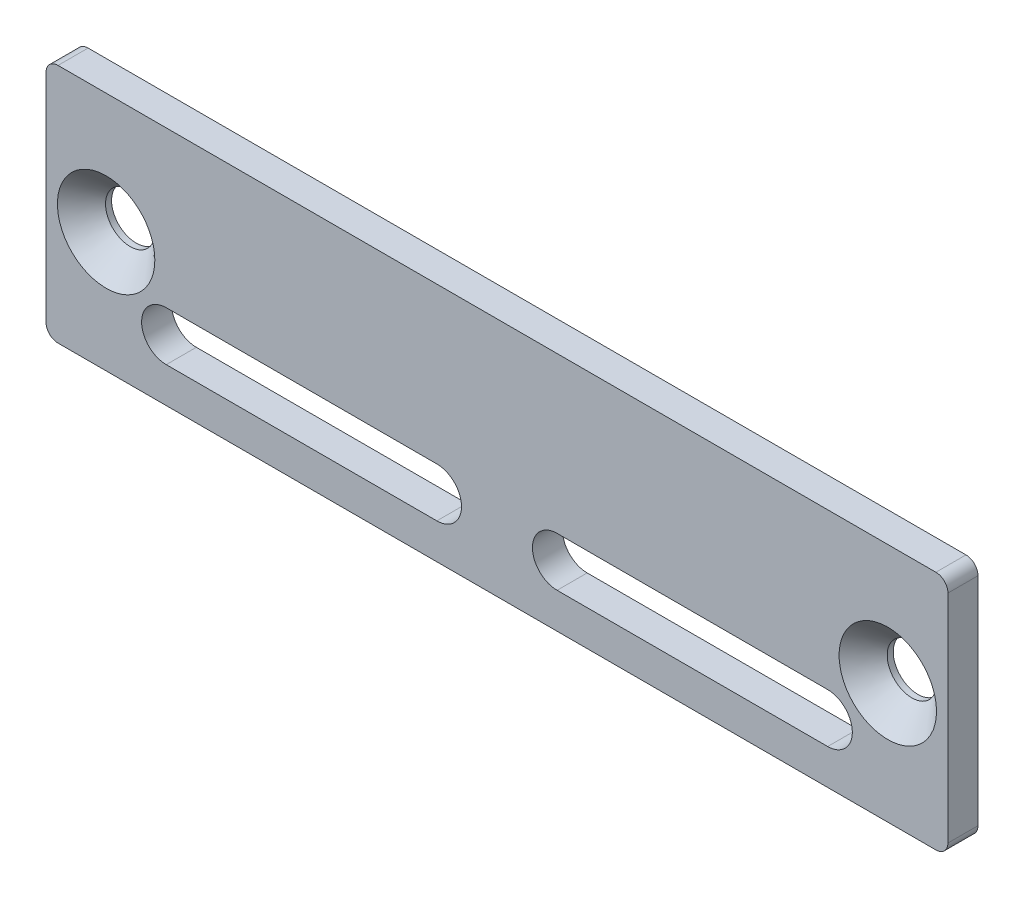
ISO-10303-21;
HEADER;
FILE_DESCRIPTION(('STEP AP214'),'2;1');
FILE_NAME('part.step','',(''),(''),'','','');
FILE_SCHEMA(('AUTOMOTIVE_DESIGN { 1 0 10303 214 1 1 1 1 }'));
ENDSEC;
DATA;
#1=APPLICATION_CONTEXT('core data for automotive mechanical design processes');
#2=APPLICATION_PROTOCOL_DEFINITION('international standard','automotive_design',2000,#1);
#3=PRODUCT_CONTEXT('',#1,'mechanical');
#4=PRODUCT('Part','Part','',(#3));
#5=PRODUCT_RELATED_PRODUCT_CATEGORY('part','',(#4));
#6=PRODUCT_DEFINITION_FORMATION('','',#4);
#7=PRODUCT_DEFINITION_CONTEXT('part definition',#1,'design');
#8=PRODUCT_DEFINITION('design','',#6,#7);
#9=PRODUCT_DEFINITION_SHAPE('','',#8);
#10=(LENGTH_UNIT() NAMED_UNIT(*) SI_UNIT(.MILLI.,.METRE.));
#11=(NAMED_UNIT(*) PLANE_ANGLE_UNIT() SI_UNIT($,.RADIAN.));
#12=(NAMED_UNIT(*) SI_UNIT($,.STERADIAN.) SOLID_ANGLE_UNIT());
#13=UNCERTAINTY_MEASURE_WITH_UNIT(LENGTH_MEASURE(1.E-05),#10,'distance_accuracy_value','');
#14=(GEOMETRIC_REPRESENTATION_CONTEXT(3) GLOBAL_UNCERTAINTY_ASSIGNED_CONTEXT((#13)) GLOBAL_UNIT_ASSIGNED_CONTEXT((#10,
#11,#12)) REPRESENTATION_CONTEXT('',''));
#15=CARTESIAN_POINT('',(0.,0.,0.));
#16=DIRECTION('',(0.,0.,1.));
#17=DIRECTION('',(1.,0.,0.));
#18=AXIS2_PLACEMENT_3D('',#15,#16,#17);
#19=CARTESIAN_POINT('',(-73.,-18.,5.));
#20=DIRECTION('',(0.,0.,-1.));
#21=DIRECTION('',(-1.,0.,0.));
#22=AXIS2_PLACEMENT_3D('',#19,#20,#21);
#23=CYLINDRICAL_SURFACE('',#22,2.);
#24=CARTESIAN_POINT('',(-73.,-18.,0.));
#25=DIRECTION('',(0.,0.,1.));
#26=DIRECTION('',(1.,0.,0.));
#27=AXIS2_PLACEMENT_3D('',#24,#25,#26);
#28=CIRCLE('',#27,2.);
#29=CARTESIAN_POINT('',(-75.,-18.,0.));
#30=VERTEX_POINT('',#29);
#31=CARTESIAN_POINT('',(-73.,-20.,0.));
#32=VERTEX_POINT('',#31);
#33=EDGE_CURVE('E203',#30,#32,#28,.T.);
#34=ORIENTED_EDGE('',*,*,#33,.T.);
#35=DIRECTION('',(0.,0.,-1.));
#36=VECTOR('',#35,1.);
#37=CARTESIAN_POINT('',(-73.,-20.,5.));
#38=LINE('',#37,#36);
#39=CARTESIAN_POINT('',(-73.,-20.,5.));
#40=VERTEX_POINT('',#39);
#41=EDGE_CURVE('E11',#40,#32,#38,.T.);
#42=ORIENTED_EDGE('',*,*,#41,.F.);
#43=CARTESIAN_POINT('',(-73.,-18.,5.));
#44=DIRECTION('',(0.,0.,1.));
#45=DIRECTION('',(1.,0.,0.));
#46=AXIS2_PLACEMENT_3D('',#43,#44,#45);
#47=CIRCLE('',#46,2.);
#48=CARTESIAN_POINT('',(-75.,-18.,5.));
#49=VERTEX_POINT('',#48);
#50=EDGE_CURVE('E250',#49,#40,#47,.T.);
#51=ORIENTED_EDGE('',*,*,#50,.F.);
#52=DIRECTION('',(0.,0.,-1.));
#53=VECTOR('',#52,1.);
#54=CARTESIAN_POINT('',(-75.,-18.,5.));
#55=LINE('',#54,#53);
#56=EDGE_CURVE('E276',#49,#30,#55,.T.);
#57=ORIENTED_EDGE('',*,*,#56,.T.);
#58=EDGE_LOOP('',(#34,#42,#51,#57));
#59=FACE_BOUND('',#58,.T.);
#60=ADVANCED_FACE('F40',(#59),#23,.T.);
#61=CARTESIAN_POINT('',(-73.,-20.,5.));
#62=DIRECTION('',(0.,1.,0.));
#63=DIRECTION('',(0.,0.,1.));
#64=AXIS2_PLACEMENT_3D('',#61,#62,#63);
#65=PLANE('',#64);
#66=DIRECTION('',(1.,0.,0.));
#67=VECTOR('',#66,1.);
#68=CARTESIAN_POINT('',(-73.,-20.,0.));
#69=LINE('',#68,#67);
#70=CARTESIAN_POINT('',(73.,-20.,0.));
#71=VERTEX_POINT('',#70);
#72=EDGE_CURVE('E280',#32,#71,#69,.T.);
#73=ORIENTED_EDGE('',*,*,#72,.T.);
#74=DIRECTION('',(0.,0.,-1.));
#75=VECTOR('',#74,1.);
#76=CARTESIAN_POINT('',(73.,-20.,5.));
#77=LINE('',#76,#75);
#78=CARTESIAN_POINT('',(73.,-20.,5.));
#79=VERTEX_POINT('',#78);
#80=EDGE_CURVE('E48',#79,#71,#77,.T.);
#81=ORIENTED_EDGE('',*,*,#80,.F.);
#82=DIRECTION('',(1.,0.,0.));
#83=VECTOR('',#82,1.);
#84=CARTESIAN_POINT('',(-73.,-20.,5.));
#85=LINE('',#84,#83);
#86=EDGE_CURVE('E254',#40,#79,#85,.T.);
#87=ORIENTED_EDGE('',*,*,#86,.F.);
#88=ORIENTED_EDGE('',*,*,#41,.T.);
#89=EDGE_LOOP('',(#73,#81,#87,#88));
#90=FACE_BOUND('',#89,.T.);
#91=ADVANCED_FACE('F350',(#90),#65,.F.);
#92=CARTESIAN_POINT('',(73.,-18.,5.));
#93=DIRECTION('',(0.,0.,-1.));
#94=DIRECTION('',(-1.,0.,0.));
#95=AXIS2_PLACEMENT_3D('',#92,#93,#94);
#96=CYLINDRICAL_SURFACE('',#95,2.);
#97=CARTESIAN_POINT('',(73.,-18.,0.));
#98=DIRECTION('',(0.,0.,1.));
#99=DIRECTION('',(1.,0.,0.));
#100=AXIS2_PLACEMENT_3D('',#97,#98,#99);
#101=CIRCLE('',#100,2.);
#102=CARTESIAN_POINT('',(75.,-18.,0.));
#103=VERTEX_POINT('',#102);
#104=EDGE_CURVE('E283',#71,#103,#101,.T.);
#105=ORIENTED_EDGE('',*,*,#104,.T.);
#106=DIRECTION('',(0.,0.,-1.));
#107=VECTOR('',#106,1.);
#108=CARTESIAN_POINT('',(75.,-18.,5.));
#109=LINE('',#108,#107);
#110=CARTESIAN_POINT('',(75.,-18.,5.));
#111=VERTEX_POINT('',#110);
#112=EDGE_CURVE('E319',#111,#103,#109,.T.);
#113=ORIENTED_EDGE('',*,*,#112,.F.);
#114=CARTESIAN_POINT('',(73.,-18.,5.));
#115=DIRECTION('',(0.,0.,1.));
#116=DIRECTION('',(1.,0.,0.));
#117=AXIS2_PLACEMENT_3D('',#114,#115,#116);
#118=CIRCLE('',#117,2.);
#119=EDGE_CURVE('E258',#79,#111,#118,.T.);
#120=ORIENTED_EDGE('',*,*,#119,.F.);
#121=ORIENTED_EDGE('',*,*,#80,.T.);
#122=EDGE_LOOP('',(#105,#113,#120,#121));
#123=FACE_BOUND('',#122,.T.);
#124=ADVANCED_FACE('F328',(#123),#96,.T.);
#125=CARTESIAN_POINT('',(75.,18.,5.));
#126=DIRECTION('',(-1.,0.,0.));
#127=DIRECTION('',(0.,0.,1.));
#128=AXIS2_PLACEMENT_3D('',#125,#126,#127);
#129=PLANE('',#128);
#130=DIRECTION('',(0.,1.,0.));
#131=VECTOR('',#130,1.);
#132=CARTESIAN_POINT('',(75.,18.,0.));
#133=LINE('',#132,#131);
#134=CARTESIAN_POINT('',(75.,18.,0.));
#135=VERTEX_POINT('',#134);
#136=EDGE_CURVE('E286',#103,#135,#133,.T.);
#137=ORIENTED_EDGE('',*,*,#136,.T.);
#138=DIRECTION('',(0.,0.,-1.));
#139=VECTOR('',#138,1.);
#140=CARTESIAN_POINT('',(75.,18.,5.));
#141=LINE('',#140,#139);
#142=CARTESIAN_POINT('',(75.,18.,5.));
#143=VERTEX_POINT('',#142);
#144=EDGE_CURVE('E315',#143,#135,#141,.T.);
#145=ORIENTED_EDGE('',*,*,#144,.F.);
#146=DIRECTION('',(0.,1.,0.));
#147=VECTOR('',#146,1.);
#148=CARTESIAN_POINT('',(75.,18.,5.));
#149=LINE('',#148,#147);
#150=EDGE_CURVE('E261',#111,#143,#149,.T.);
#151=ORIENTED_EDGE('',*,*,#150,.F.);
#152=ORIENTED_EDGE('',*,*,#112,.T.);
#153=EDGE_LOOP('',(#137,#145,#151,#152));
#154=FACE_BOUND('',#153,.T.);
#155=ADVANCED_FACE('F338',(#154),#129,.F.);
#156=CARTESIAN_POINT('',(73.,18.,5.));
#157=DIRECTION('',(0.,0.,-1.));
#158=DIRECTION('',(-1.,0.,0.));
#159=AXIS2_PLACEMENT_3D('',#156,#157,#158);
#160=CYLINDRICAL_SURFACE('',#159,2.);
#161=CARTESIAN_POINT('',(73.,18.,0.));
#162=DIRECTION('',(0.,0.,1.));
#163=DIRECTION('',(-1.,0.,0.));
#164=AXIS2_PLACEMENT_3D('',#161,#162,#163);
#165=CIRCLE('',#164,2.);
#166=CARTESIAN_POINT('',(73.,20.,0.));
#167=VERTEX_POINT('',#166);
#168=EDGE_CURVE('E289',#135,#167,#165,.T.);
#169=ORIENTED_EDGE('',*,*,#168,.T.);
#170=DIRECTION('',(0.,0.,-1.));
#171=VECTOR('',#170,1.);
#172=CARTESIAN_POINT('',(73.,20.,5.));
#173=LINE('',#172,#171);
#174=CARTESIAN_POINT('',(73.,20.,5.));
#175=VERTEX_POINT('',#174);
#176=EDGE_CURVE('E311',#175,#167,#173,.T.);
#177=ORIENTED_EDGE('',*,*,#176,.F.);
#178=CARTESIAN_POINT('',(73.,18.,5.));
#179=DIRECTION('',(0.,0.,1.));
#180=DIRECTION('',(-1.,0.,0.));
#181=AXIS2_PLACEMENT_3D('',#178,#179,#180);
#182=CIRCLE('',#181,2.);
#183=EDGE_CURVE('E264',#143,#175,#182,.T.);
#184=ORIENTED_EDGE('',*,*,#183,.F.);
#185=ORIENTED_EDGE('',*,*,#144,.T.);
#186=EDGE_LOOP('',(#169,#177,#184,#185));
#187=FACE_BOUND('',#186,.T.);
#188=ADVANCED_FACE('F342',(#187),#160,.T.);
#189=CARTESIAN_POINT('',(-73.,20.,5.));
#190=DIRECTION('',(0.,-1.,0.));
#191=DIRECTION('',(0.,0.,-1.));
#192=AXIS2_PLACEMENT_3D('',#189,#190,#191);
#193=PLANE('',#192);
#194=DIRECTION('',(-1.,0.,0.));
#195=VECTOR('',#194,1.);
#196=CARTESIAN_POINT('',(-73.,20.,0.));
#197=LINE('',#196,#195);
#198=CARTESIAN_POINT('',(-73.,20.,0.));
#199=VERTEX_POINT('',#198);
#200=EDGE_CURVE('E292',#167,#199,#197,.T.);
#201=ORIENTED_EDGE('',*,*,#200,.T.);
#202=DIRECTION('',(0.,0.,-1.));
#203=VECTOR('',#202,1.);
#204=CARTESIAN_POINT('',(-73.,20.,5.));
#205=LINE('',#204,#203);
#206=CARTESIAN_POINT('',(-73.,20.,5.));
#207=VERTEX_POINT('',#206);
#208=EDGE_CURVE('E307',#207,#199,#205,.T.);
#209=ORIENTED_EDGE('',*,*,#208,.F.);
#210=DIRECTION('',(-1.,0.,0.));
#211=VECTOR('',#210,1.);
#212=CARTESIAN_POINT('',(-73.,20.,5.));
#213=LINE('',#212,#211);
#214=EDGE_CURVE('E267',#175,#207,#213,.T.);
#215=ORIENTED_EDGE('',*,*,#214,.F.);
#216=ORIENTED_EDGE('',*,*,#176,.T.);
#217=EDGE_LOOP('',(#201,#209,#215,#216));
#218=FACE_BOUND('',#217,.T.);
#219=ADVANCED_FACE('F363',(#218),#193,.F.);
#220=CARTESIAN_POINT('',(-73.,18.,5.));
#221=DIRECTION('',(0.,0.,-1.));
#222=DIRECTION('',(-1.,0.,0.));
#223=AXIS2_PLACEMENT_3D('',#220,#221,#222);
#224=CYLINDRICAL_SURFACE('',#223,2.);
#225=CARTESIAN_POINT('',(-73.,18.,0.));
#226=DIRECTION('',(0.,0.,1.));
#227=DIRECTION('',(1.,0.,0.));
#228=AXIS2_PLACEMENT_3D('',#225,#226,#227);
#229=CIRCLE('',#228,2.);
#230=CARTESIAN_POINT('',(-75.,18.,0.));
#231=VERTEX_POINT('',#230);
#232=EDGE_CURVE('E295',#199,#231,#229,.T.);
#233=ORIENTED_EDGE('',*,*,#232,.T.);
#234=DIRECTION('',(0.,0.,-1.));
#235=VECTOR('',#234,1.);
#236=CARTESIAN_POINT('',(-75.,18.,5.));
#237=LINE('',#236,#235);
#238=CARTESIAN_POINT('',(-75.,18.,5.));
#239=VERTEX_POINT('',#238);
#240=EDGE_CURVE('E303',#239,#231,#237,.T.);
#241=ORIENTED_EDGE('',*,*,#240,.F.);
#242=CARTESIAN_POINT('',(-73.,18.,5.));
#243=DIRECTION('',(0.,0.,1.));
#244=DIRECTION('',(1.,0.,0.));
#245=AXIS2_PLACEMENT_3D('',#242,#243,#244);
#246=CIRCLE('',#245,2.);
#247=EDGE_CURVE('E270',#207,#239,#246,.T.);
#248=ORIENTED_EDGE('',*,*,#247,.F.);
#249=ORIENTED_EDGE('',*,*,#208,.T.);
#250=EDGE_LOOP('',(#233,#241,#248,#249));
#251=FACE_BOUND('',#250,.T.);
#252=ADVANCED_FACE('F361',(#251),#224,.T.);
#253=CARTESIAN_POINT('',(-75.,18.,5.));
#254=DIRECTION('',(1.,0.,0.));
#255=DIRECTION('',(0.,0.,-1.));
#256=AXIS2_PLACEMENT_3D('',#253,#254,#255);
#257=PLANE('',#256);
#258=DIRECTION('',(0.,-1.,0.));
#259=VECTOR('',#258,1.);
#260=CARTESIAN_POINT('',(-75.,18.,0.));
#261=LINE('',#260,#259);
#262=EDGE_CURVE('E255',#231,#30,#261,.T.);
#263=ORIENTED_EDGE('',*,*,#262,.T.);
#264=ORIENTED_EDGE('',*,*,#56,.F.);
#265=DIRECTION('',(0.,-1.,0.));
#266=VECTOR('',#265,1.);
#267=CARTESIAN_POINT('',(-75.,18.,5.));
#268=LINE('',#267,#266);
#269=EDGE_CURVE('E273',#239,#49,#268,.T.);
#270=ORIENTED_EDGE('',*,*,#269,.F.);
#271=ORIENTED_EDGE('',*,*,#240,.T.);
#272=EDGE_LOOP('',(#263,#264,#270,#271));
#273=FACE_BOUND('',#272,.T.);
#274=ADVANCED_FACE('F356',(#273),#257,.F.);
#275=CARTESIAN_POINT('',(-73.,-18.,5.));
#276=DIRECTION('',(0.,0.,1.));
#277=DIRECTION('',(1.,0.,0.));
#278=AXIS2_PLACEMENT_3D('',#275,#276,#277);
#279=PLANE('',#278);
#280=CARTESIAN_POINT('',(-65.,0.,5.));
#281=DIRECTION('',(0.,0.,1.));
#282=DIRECTION('',(1.,0.,0.));
#283=AXIS2_PLACEMENT_3D('',#280,#281,#282);
#284=CIRCLE('',#283,8.1);
#285=CARTESIAN_POINT('',(-56.9,0.,5.));
#286=VERTEX_POINT('',#285);
#287=EDGE_CURVE('E551',#286,#286,#284,.T.);
#288=ORIENTED_EDGE('',*,*,#287,.F.);
#289=EDGE_LOOP('',(#288));
#290=FACE_BOUND('',#289,.T.);
#291=CARTESIAN_POINT('',(65.,0.,5.));
#292=DIRECTION('',(0.,0.,1.));
#293=DIRECTION('',(1.,0.,0.));
#294=AXIS2_PLACEMENT_3D('',#291,#292,#293);
#295=CIRCLE('',#294,8.1);
#296=CARTESIAN_POINT('',(73.1,0.,5.));
#297=VERTEX_POINT('',#296);
#298=EDGE_CURVE('E561',#297,#297,#295,.T.);
#299=ORIENTED_EDGE('',*,*,#298,.F.);
#300=EDGE_LOOP('',(#299));
#301=FACE_BOUND('',#300,.T.);
#302=CARTESIAN_POINT('',(-55.,-9.99999999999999,5.));
#303=DIRECTION('',(0.,0.,1.));
#304=DIRECTION('',(1.,0.,0.));
#305=AXIS2_PLACEMENT_3D('',#302,#303,#304);
#306=CIRCLE('',#305,4.09999999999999);
#307=CARTESIAN_POINT('',(-55.,-5.90000000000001,5.));
#308=VERTEX_POINT('',#307);
#309=CARTESIAN_POINT('',(-55.,-14.1,5.));
#310=VERTEX_POINT('',#309);
#311=EDGE_CURVE('E55',#308,#310,#306,.T.);
#312=ORIENTED_EDGE('',*,*,#311,.F.);
#313=DIRECTION('',(-1.,0.,0.));
#314=VECTOR('',#313,1.);
#315=CARTESIAN_POINT('',(-55.,-5.90000000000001,5.));
#316=LINE('',#315,#314);
#317=CARTESIAN_POINT('',(-10.,-5.90000000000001,5.));
#318=VERTEX_POINT('',#317);
#319=EDGE_CURVE('E177',#318,#308,#316,.T.);
#320=ORIENTED_EDGE('',*,*,#319,.F.);
#321=CARTESIAN_POINT('',(-10.,-9.99999999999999,5.));
#322=DIRECTION('',(0.,0.,1.));
#323=DIRECTION('',(1.,0.,0.));
#324=AXIS2_PLACEMENT_3D('',#321,#322,#323);
#325=CIRCLE('',#324,4.09999999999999);
#326=CARTESIAN_POINT('',(-10.,-14.1,5.));
#327=VERTEX_POINT('',#326);
#328=EDGE_CURVE('E181',#327,#318,#325,.T.);
#329=ORIENTED_EDGE('',*,*,#328,.F.);
#330=DIRECTION('',(1.,0.,0.));
#331=VECTOR('',#330,1.);
#332=CARTESIAN_POINT('',(-55.,-14.1,5.));
#333=LINE('',#332,#331);
#334=EDGE_CURVE('E193',#310,#327,#333,.T.);
#335=ORIENTED_EDGE('',*,*,#334,.F.);
#336=EDGE_LOOP('',(#312,#320,#329,#335));
#337=FACE_BOUND('',#336,.T.);
#338=CARTESIAN_POINT('',(55.,-9.99999999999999,5.));
#339=DIRECTION('',(0.,0.,1.));
#340=DIRECTION('',(-1.,0.,0.));
#341=AXIS2_PLACEMENT_3D('',#338,#339,#340);
#342=CIRCLE('',#341,4.09999999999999);
#343=CARTESIAN_POINT('',(55.,-14.1,5.));
#344=VERTEX_POINT('',#343);
#345=CARTESIAN_POINT('',(55.,-5.90000000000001,5.));
#346=VERTEX_POINT('',#345);
#347=EDGE_CURVE('E63',#344,#346,#342,.T.);
#348=ORIENTED_EDGE('',*,*,#347,.F.);
#349=DIRECTION('',(1.,0.,0.));
#350=VECTOR('',#349,1.);
#351=CARTESIAN_POINT('',(55.,-14.1,5.));
#352=LINE('',#351,#350);
#353=CARTESIAN_POINT('',(10.,-14.1,5.));
#354=VERTEX_POINT('',#353);
#355=EDGE_CURVE('E214',#354,#344,#352,.T.);
#356=ORIENTED_EDGE('',*,*,#355,.F.);
#357=CARTESIAN_POINT('',(10.,-9.99999999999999,5.));
#358=DIRECTION('',(0.,0.,1.));
#359=DIRECTION('',(-1.,0.,0.));
#360=AXIS2_PLACEMENT_3D('',#357,#358,#359);
#361=CIRCLE('',#360,4.09999999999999);
#362=CARTESIAN_POINT('',(10.,-5.90000000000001,5.));
#363=VERTEX_POINT('',#362);
#364=EDGE_CURVE('E233',#363,#354,#361,.T.);
#365=ORIENTED_EDGE('',*,*,#364,.F.);
#366=DIRECTION('',(-1.,0.,0.));
#367=VECTOR('',#366,1.);
#368=CARTESIAN_POINT('',(55.,-5.90000000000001,5.));
#369=LINE('',#368,#367);
#370=EDGE_CURVE('E229',#346,#363,#369,.T.);
#371=ORIENTED_EDGE('',*,*,#370,.F.);
#372=EDGE_LOOP('',(#348,#356,#365,#371));
#373=FACE_BOUND('',#372,.T.);
#374=ORIENTED_EDGE('',*,*,#50,.T.);
#375=ORIENTED_EDGE('',*,*,#86,.T.);
#376=ORIENTED_EDGE('',*,*,#119,.T.);
#377=ORIENTED_EDGE('',*,*,#150,.T.);
#378=ORIENTED_EDGE('',*,*,#183,.T.);
#379=ORIENTED_EDGE('',*,*,#214,.T.);
#380=ORIENTED_EDGE('',*,*,#247,.T.);
#381=ORIENTED_EDGE('',*,*,#269,.T.);
#382=EDGE_LOOP('',(#374,#375,#376,#377,#378,#379,#380,#381));
#383=FACE_BOUND('',#382,.T.);
#384=ADVANCED_FACE('F346',(#290,#301,#337,#373,#383),#279,.T.);
#385=CARTESIAN_POINT('',(-73.,-18.,0.));
#386=DIRECTION('',(0.,0.,1.));
#387=DIRECTION('',(1.,0.,0.));
#388=AXIS2_PLACEMENT_3D('',#385,#386,#387);
#389=PLANE('',#388);
#390=CARTESIAN_POINT('',(-65.,0.,0.));
#391=DIRECTION('',(0.,0.,1.));
#392=DIRECTION('',(1.,0.,0.));
#393=AXIS2_PLACEMENT_3D('',#390,#391,#392);
#394=CIRCLE('',#393,4.09999999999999);
#395=CARTESIAN_POINT('',(-60.9,0.,0.));
#396=VERTEX_POINT('',#395);
#397=EDGE_CURVE('E555',#396,#396,#394,.T.);
#398=ORIENTED_EDGE('',*,*,#397,.T.);
#399=EDGE_LOOP('',(#398));
#400=FACE_BOUND('',#399,.T.);
#401=CARTESIAN_POINT('',(65.,0.,0.));
#402=DIRECTION('',(0.,0.,1.));
#403=DIRECTION('',(1.,0.,0.));
#404=AXIS2_PLACEMENT_3D('',#401,#402,#403);
#405=CIRCLE('',#404,4.09999999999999);
#406=CARTESIAN_POINT('',(69.1,0.,0.));
#407=VERTEX_POINT('',#406);
#408=EDGE_CURVE('E184',#407,#407,#405,.T.);
#409=ORIENTED_EDGE('',*,*,#408,.T.);
#410=EDGE_LOOP('',(#409));
#411=FACE_BOUND('',#410,.T.);
#412=DIRECTION('',(-1.,0.,0.));
#413=VECTOR('',#412,1.);
#414=CARTESIAN_POINT('',(-55.,-5.90000000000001,0.));
#415=LINE('',#414,#413);
#416=CARTESIAN_POINT('',(-10.,-5.90000000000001,0.));
#417=VERTEX_POINT('',#416);
#418=CARTESIAN_POINT('',(-55.,-5.90000000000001,0.));
#419=VERTEX_POINT('',#418);
#420=EDGE_CURVE('E162',#417,#419,#415,.T.);
#421=ORIENTED_EDGE('',*,*,#420,.T.);
#422=CARTESIAN_POINT('',(-55.,-9.99999999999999,0.));
#423=DIRECTION('',(0.,0.,1.));
#424=DIRECTION('',(1.,0.,0.));
#425=AXIS2_PLACEMENT_3D('',#422,#423,#424);
#426=CIRCLE('',#425,4.09999999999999);
#427=CARTESIAN_POINT('',(-55.,-14.1,0.));
#428=VERTEX_POINT('',#427);
#429=EDGE_CURVE('E155',#419,#428,#426,.T.);
#430=ORIENTED_EDGE('',*,*,#429,.T.);
#431=DIRECTION('',(1.,0.,0.));
#432=VECTOR('',#431,1.);
#433=CARTESIAN_POINT('',(-55.,-14.1,0.));
#434=LINE('',#433,#432);
#435=CARTESIAN_POINT('',(-10.,-14.1,0.));
#436=VERTEX_POINT('',#435);
#437=EDGE_CURVE('E166',#428,#436,#434,.T.);
#438=ORIENTED_EDGE('',*,*,#437,.T.);
#439=CARTESIAN_POINT('',(-10.,-9.99999999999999,0.));
#440=DIRECTION('',(0.,0.,1.));
#441=DIRECTION('',(1.,0.,0.));
#442=AXIS2_PLACEMENT_3D('',#439,#440,#441);
#443=CIRCLE('',#442,4.09999999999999);
#444=EDGE_CURVE('E171',#436,#417,#443,.T.);
#445=ORIENTED_EDGE('',*,*,#444,.T.);
#446=EDGE_LOOP('',(#421,#430,#438,#445));
#447=FACE_BOUND('',#446,.T.);
#448=DIRECTION('',(1.,0.,0.));
#449=VECTOR('',#448,1.);
#450=CARTESIAN_POINT('',(55.,-14.1,0.));
#451=LINE('',#450,#449);
#452=CARTESIAN_POINT('',(10.,-14.1,0.));
#453=VERTEX_POINT('',#452);
#454=CARTESIAN_POINT('',(55.,-14.1,0.));
#455=VERTEX_POINT('',#454);
#456=EDGE_CURVE('E222',#453,#455,#451,.T.);
#457=ORIENTED_EDGE('',*,*,#456,.T.);
#458=CARTESIAN_POINT('',(55.,-9.99999999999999,0.));
#459=DIRECTION('',(0.,0.,1.));
#460=DIRECTION('',(-1.,0.,0.));
#461=AXIS2_PLACEMENT_3D('',#458,#459,#460);
#462=CIRCLE('',#461,4.09999999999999);
#463=CARTESIAN_POINT('',(55.,-5.90000000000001,0.));
#464=VERTEX_POINT('',#463);
#465=EDGE_CURVE('E209',#455,#464,#462,.T.);
#466=ORIENTED_EDGE('',*,*,#465,.T.);
#467=DIRECTION('',(-1.,0.,0.));
#468=VECTOR('',#467,1.);
#469=CARTESIAN_POINT('',(55.,-5.90000000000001,0.));
#470=LINE('',#469,#468);
#471=CARTESIAN_POINT('',(9.99999999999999,-5.90000000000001,0.));
#472=VERTEX_POINT('',#471);
#473=EDGE_CURVE('E213',#464,#472,#470,.T.);
#474=ORIENTED_EDGE('',*,*,#473,.T.);
#475=CARTESIAN_POINT('',(10.,-9.99999999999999,0.));
#476=DIRECTION('',(0.,0.,1.));
#477=DIRECTION('',(-1.,0.,0.));
#478=AXIS2_PLACEMENT_3D('',#475,#476,#477);
#479=CIRCLE('',#478,4.09999999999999);
#480=EDGE_CURVE('E218',#472,#453,#479,.T.);
#481=ORIENTED_EDGE('',*,*,#480,.T.);
#482=EDGE_LOOP('',(#457,#466,#474,#481));
#483=FACE_BOUND('',#482,.T.);
#484=ORIENTED_EDGE('',*,*,#33,.F.);
#485=ORIENTED_EDGE('',*,*,#262,.F.);
#486=ORIENTED_EDGE('',*,*,#232,.F.);
#487=ORIENTED_EDGE('',*,*,#200,.F.);
#488=ORIENTED_EDGE('',*,*,#168,.F.);
#489=ORIENTED_EDGE('',*,*,#136,.F.);
#490=ORIENTED_EDGE('',*,*,#104,.F.);
#491=ORIENTED_EDGE('',*,*,#72,.F.);
#492=EDGE_LOOP('',(#484,#485,#486,#487,#488,#489,#490,#491));
#493=FACE_BOUND('',#492,.T.);
#494=ADVANCED_FACE('F173',(#400,#411,#447,#483,#493),#389,.F.);
#495=CARTESIAN_POINT('',(55.,-9.99999999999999,0.));
#496=DIRECTION('',(0.,0.,1.));
#497=DIRECTION('',(1.,0.,0.));
#498=AXIS2_PLACEMENT_3D('',#495,#496,#497);
#499=CYLINDRICAL_SURFACE('',#498,4.09999999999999);
#500=ORIENTED_EDGE('',*,*,#347,.T.);
#501=DIRECTION('',(0.,0.,1.));
#502=VECTOR('',#501,1.);
#503=CARTESIAN_POINT('',(55.,-5.90000000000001,0.));
#504=LINE('',#503,#502);
#505=EDGE_CURVE('E226',#464,#346,#504,.T.);
#506=ORIENTED_EDGE('',*,*,#505,.F.);
#507=ORIENTED_EDGE('',*,*,#465,.F.);
#508=DIRECTION('',(0.,0.,1.));
#509=VECTOR('',#508,1.);
#510=CARTESIAN_POINT('',(55.,-14.1,0.));
#511=LINE('',#510,#509);
#512=EDGE_CURVE('E194',#455,#344,#511,.T.);
#513=ORIENTED_EDGE('',*,*,#512,.T.);
#514=EDGE_LOOP('',(#500,#506,#507,#513));
#515=FACE_BOUND('',#514,.T.);
#516=ADVANCED_FACE('F415',(#515),#499,.F.);
#517=CARTESIAN_POINT('',(55.,-14.1,0.));
#518=DIRECTION('',(0.,-1.,0.));
#519=DIRECTION('',(1.,0.,0.));
#520=AXIS2_PLACEMENT_3D('',#517,#518,#519);
#521=PLANE('',#520);
#522=ORIENTED_EDGE('',*,*,#355,.T.);
#523=ORIENTED_EDGE('',*,*,#512,.F.);
#524=ORIENTED_EDGE('',*,*,#456,.F.);
#525=DIRECTION('',(0.,0.,1.));
#526=VECTOR('',#525,1.);
#527=CARTESIAN_POINT('',(10.,-14.1,0.));
#528=LINE('',#527,#526);
#529=EDGE_CURVE('E242',#453,#354,#528,.T.);
#530=ORIENTED_EDGE('',*,*,#529,.T.);
#531=EDGE_LOOP('',(#522,#523,#524,#530));
#532=FACE_BOUND('',#531,.T.);
#533=ADVANCED_FACE('F420',(#532),#521,.F.);
#534=CARTESIAN_POINT('',(10.,-9.99999999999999,0.));
#535=DIRECTION('',(0.,0.,1.));
#536=DIRECTION('',(1.,0.,0.));
#537=AXIS2_PLACEMENT_3D('',#534,#535,#536);
#538=CYLINDRICAL_SURFACE('',#537,4.09999999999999);
#539=ORIENTED_EDGE('',*,*,#364,.T.);
#540=ORIENTED_EDGE('',*,*,#529,.F.);
#541=ORIENTED_EDGE('',*,*,#480,.F.);
#542=DIRECTION('',(0.,0.,1.));
#543=VECTOR('',#542,1.);
#544=CARTESIAN_POINT('',(10.,-5.90000000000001,0.));
#545=LINE('',#544,#543);
#546=EDGE_CURVE('E245',#472,#363,#545,.T.);
#547=ORIENTED_EDGE('',*,*,#546,.T.);
#548=EDGE_LOOP('',(#539,#540,#541,#547));
#549=FACE_BOUND('',#548,.T.);
#550=ADVANCED_FACE('F431',(#549),#538,.F.);
#551=CARTESIAN_POINT('',(55.,-5.90000000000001,0.));
#552=DIRECTION('',(0.,1.,0.));
#553=DIRECTION('',(0.,0.,1.));
#554=AXIS2_PLACEMENT_3D('',#551,#552,#553);
#555=PLANE('',#554);
#556=ORIENTED_EDGE('',*,*,#370,.T.);
#557=ORIENTED_EDGE('',*,*,#546,.F.);
#558=ORIENTED_EDGE('',*,*,#473,.F.);
#559=ORIENTED_EDGE('',*,*,#505,.T.);
#560=EDGE_LOOP('',(#556,#557,#558,#559));
#561=FACE_BOUND('',#560,.T.);
#562=ADVANCED_FACE('F441',(#561),#555,.F.);
#563=CARTESIAN_POINT('',(-55.,-9.99999999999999,0.));
#564=DIRECTION('',(0.,0.,1.));
#565=DIRECTION('',(1.,0.,0.));
#566=AXIS2_PLACEMENT_3D('',#563,#564,#565);
#567=CYLINDRICAL_SURFACE('',#566,4.09999999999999);
#568=ORIENTED_EDGE('',*,*,#311,.T.);
#569=DIRECTION('',(0.,0.,1.));
#570=VECTOR('',#569,1.);
#571=CARTESIAN_POINT('',(-55.,-14.1,0.));
#572=LINE('',#571,#570);
#573=EDGE_CURVE('E151',#428,#310,#572,.T.);
#574=ORIENTED_EDGE('',*,*,#573,.F.);
#575=ORIENTED_EDGE('',*,*,#429,.F.);
#576=DIRECTION('',(0.,0.,1.));
#577=VECTOR('',#576,1.);
#578=CARTESIAN_POINT('',(-55.,-5.90000000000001,0.));
#579=LINE('',#578,#577);
#580=EDGE_CURVE('E200',#419,#308,#579,.T.);
#581=ORIENTED_EDGE('',*,*,#580,.T.);
#582=EDGE_LOOP('',(#568,#574,#575,#581));
#583=FACE_BOUND('',#582,.T.);
#584=ADVANCED_FACE('F153',(#583),#567,.F.);
#585=CARTESIAN_POINT('',(-55.,-5.90000000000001,0.));
#586=DIRECTION('',(0.,1.,0.));
#587=DIRECTION('',(0.,0.,1.));
#588=AXIS2_PLACEMENT_3D('',#585,#586,#587);
#589=PLANE('',#588);
#590=ORIENTED_EDGE('',*,*,#319,.T.);
#591=ORIENTED_EDGE('',*,*,#580,.F.);
#592=ORIENTED_EDGE('',*,*,#420,.F.);
#593=DIRECTION('',(0.,0.,1.));
#594=VECTOR('',#593,1.);
#595=CARTESIAN_POINT('',(-10.,-5.90000000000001,0.));
#596=LINE('',#595,#594);
#597=EDGE_CURVE('E204',#417,#318,#596,.T.);
#598=ORIENTED_EDGE('',*,*,#597,.T.);
#599=EDGE_LOOP('',(#590,#591,#592,#598));
#600=FACE_BOUND('',#599,.T.);
#601=ADVANCED_FACE('F460',(#600),#589,.F.);
#602=CARTESIAN_POINT('',(-10.,-9.99999999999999,0.));
#603=DIRECTION('',(0.,0.,1.));
#604=DIRECTION('',(1.,0.,0.));
#605=AXIS2_PLACEMENT_3D('',#602,#603,#604);
#606=CYLINDRICAL_SURFACE('',#605,4.09999999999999);
#607=ORIENTED_EDGE('',*,*,#328,.T.);
#608=ORIENTED_EDGE('',*,*,#597,.F.);
#609=ORIENTED_EDGE('',*,*,#444,.F.);
#610=DIRECTION('',(0.,0.,1.));
#611=VECTOR('',#610,1.);
#612=CARTESIAN_POINT('',(-10.,-14.1,0.));
#613=LINE('',#612,#611);
#614=EDGE_CURVE('E161',#436,#327,#613,.T.);
#615=ORIENTED_EDGE('',*,*,#614,.T.);
#616=EDGE_LOOP('',(#607,#608,#609,#615));
#617=FACE_BOUND('',#616,.T.);
#618=ADVANCED_FACE('F469',(#617),#606,.F.);
#619=CARTESIAN_POINT('',(-55.,-14.1,0.));
#620=DIRECTION('',(0.,-1.,0.));
#621=DIRECTION('',(1.,0.,0.));
#622=AXIS2_PLACEMENT_3D('',#619,#620,#621);
#623=PLANE('',#622);
#624=ORIENTED_EDGE('',*,*,#334,.T.);
#625=ORIENTED_EDGE('',*,*,#614,.F.);
#626=ORIENTED_EDGE('',*,*,#437,.F.);
#627=ORIENTED_EDGE('',*,*,#573,.T.);
#628=EDGE_LOOP('',(#624,#625,#626,#627));
#629=FACE_BOUND('',#628,.T.);
#630=ADVANCED_FACE('F167',(#629),#623,.F.);
#631=CARTESIAN_POINT('',(65.,0.,5.));
#632=DIRECTION('',(0.,0.,1.));
#633=DIRECTION('',(1.,0.,0.));
#634=AXIS2_PLACEMENT_3D('',#631,#632,#633);
#635=CYLINDRICAL_SURFACE('',#634,4.09999999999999);
#636=ORIENTED_EDGE('',*,*,#408,.F.);
#637=EDGE_LOOP('',(#636));
#638=FACE_BOUND('',#637,.T.);
#639=CARTESIAN_POINT('',(65.,0.,1.));
#640=DIRECTION('',(0.,0.,1.));
#641=DIRECTION('',(1.,0.,0.));
#642=AXIS2_PLACEMENT_3D('',#639,#640,#641);
#643=CIRCLE('',#642,4.09999999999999);
#644=CARTESIAN_POINT('',(69.1,0.,1.));
#645=VERTEX_POINT('',#644);
#646=EDGE_CURVE('E564',#645,#645,#643,.T.);
#647=ORIENTED_EDGE('',*,*,#646,.T.);
#648=EDGE_LOOP('',(#647));
#649=FACE_BOUND('',#648,.T.);
#650=ADVANCED_FACE('F488',(#638,#649),#635,.F.);
#651=CARTESIAN_POINT('',(65.,0.,5.));
#652=DIRECTION('',(0.,0.,1.));
#653=DIRECTION('',(1.,0.,0.));
#654=AXIS2_PLACEMENT_3D('',#651,#652,#653);
#655=CONICAL_SURFACE('',#654,8.1,0.785398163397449);
#656=ORIENTED_EDGE('',*,*,#646,.F.);
#657=EDGE_LOOP('',(#656));
#658=FACE_BOUND('',#657,.T.);
#659=ORIENTED_EDGE('',*,*,#298,.T.);
#660=EDGE_LOOP('',(#659));
#661=FACE_BOUND('',#660,.T.);
#662=ADVANCED_FACE('F511',(#658,#661),#655,.F.);
#663=CARTESIAN_POINT('',(-65.,0.,5.));
#664=DIRECTION('',(0.,0.,1.));
#665=DIRECTION('',(1.,0.,0.));
#666=AXIS2_PLACEMENT_3D('',#663,#664,#665);
#667=CYLINDRICAL_SURFACE('',#666,4.09999999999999);
#668=ORIENTED_EDGE('',*,*,#397,.F.);
#669=EDGE_LOOP('',(#668));
#670=FACE_BOUND('',#669,.T.);
#671=CARTESIAN_POINT('',(-65.,0.,1.));
#672=DIRECTION('',(0.,0.,1.));
#673=DIRECTION('',(1.,0.,0.));
#674=AXIS2_PLACEMENT_3D('',#671,#672,#673);
#675=CIRCLE('',#674,4.1);
#676=CARTESIAN_POINT('',(-60.9,0.,1.));
#677=VERTEX_POINT('',#676);
#678=EDGE_CURVE('E548',#677,#677,#675,.T.);
#679=ORIENTED_EDGE('',*,*,#678,.T.);
#680=EDGE_LOOP('',(#679));
#681=FACE_BOUND('',#680,.T.);
#682=ADVANCED_FACE('F521',(#670,#681),#667,.F.);
#683=CARTESIAN_POINT('',(-65.,0.,5.));
#684=DIRECTION('',(0.,0.,1.));
#685=DIRECTION('',(1.,0.,0.));
#686=AXIS2_PLACEMENT_3D('',#683,#684,#685);
#687=CONICAL_SURFACE('',#686,8.1,0.785398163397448);
#688=ORIENTED_EDGE('',*,*,#678,.F.);
#689=EDGE_LOOP('',(#688));
#690=FACE_BOUND('',#689,.T.);
#691=ORIENTED_EDGE('',*,*,#287,.T.);
#692=EDGE_LOOP('',(#691));
#693=FACE_BOUND('',#692,.T.);
#694=ADVANCED_FACE('F531',(#690,#693),#687,.F.);
#695=CLOSED_SHELL('',(#60,#91,#124,#155,#188,#219,#252,#274,#384,#494,#516,#533,#550,#562,#584,
#601,#618,#630,#650,#662,#682,#694));
#696=MANIFOLD_SOLID_BREP('B2',#695);
#697=ADVANCED_BREP_SHAPE_REPRESENTATION('',(#18,#696),#14);
#698=SHAPE_DEFINITION_REPRESENTATION(#9,#697);
ENDSEC;
END-ISO-10303-21;
